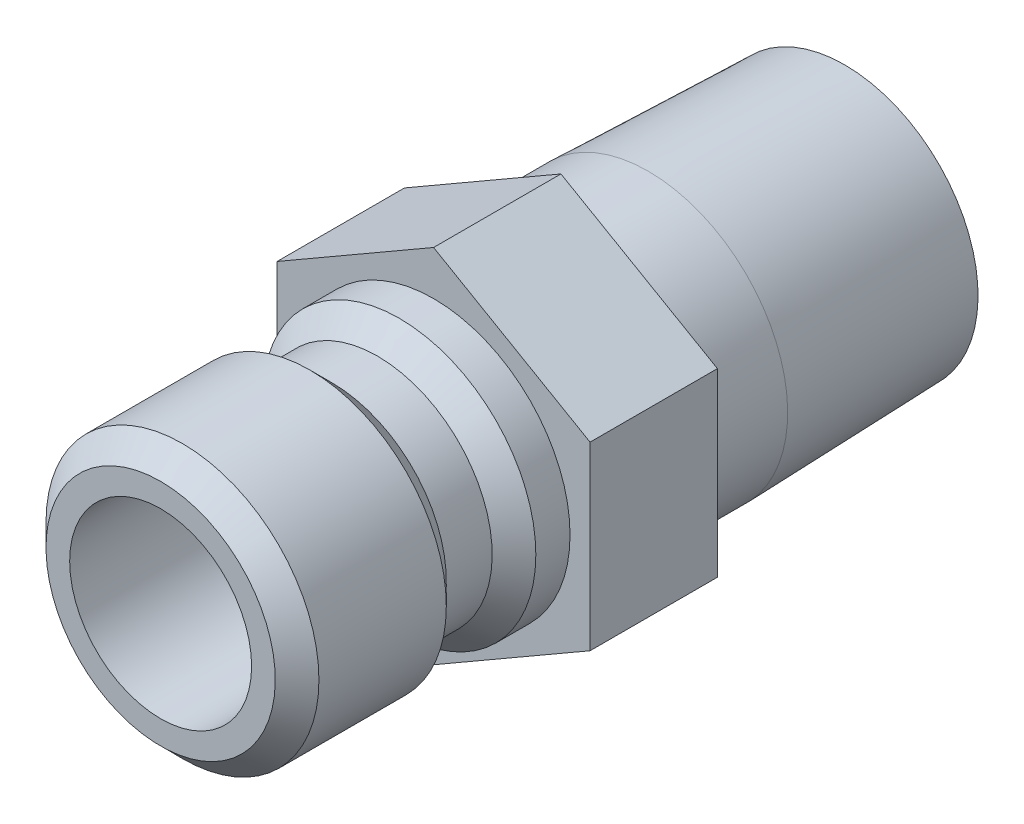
ISO-10303-21;
HEADER;
FILE_DESCRIPTION(('STEP AP214'),'2;1');
FILE_NAME('part.step','',(''),(''),'','','');
FILE_SCHEMA(('AUTOMOTIVE_DESIGN { 1 0 10303 214 1 1 1 1 }'));
ENDSEC;
DATA;
#1=APPLICATION_CONTEXT('core data for automotive mechanical design processes');
#2=APPLICATION_PROTOCOL_DEFINITION('international standard','automotive_design',2000,#1);
#3=PRODUCT_CONTEXT('',#1,'mechanical');
#4=PRODUCT('Part','Part','',(#3));
#5=PRODUCT_RELATED_PRODUCT_CATEGORY('part','',(#4));
#6=PRODUCT_DEFINITION_FORMATION('','',#4);
#7=PRODUCT_DEFINITION_CONTEXT('part definition',#1,'design');
#8=PRODUCT_DEFINITION('design','',#6,#7);
#9=PRODUCT_DEFINITION_SHAPE('','',#8);
#10=(LENGTH_UNIT() NAMED_UNIT(*) SI_UNIT(.MILLI.,.METRE.));
#11=(NAMED_UNIT(*) PLANE_ANGLE_UNIT() SI_UNIT($,.RADIAN.));
#12=(NAMED_UNIT(*) SI_UNIT($,.STERADIAN.) SOLID_ANGLE_UNIT());
#13=UNCERTAINTY_MEASURE_WITH_UNIT(LENGTH_MEASURE(1.E-05),#10,'distance_accuracy_value','');
#14=(GEOMETRIC_REPRESENTATION_CONTEXT(3) GLOBAL_UNCERTAINTY_ASSIGNED_CONTEXT((#13)) GLOBAL_UNIT_ASSIGNED_CONTEXT((#10,
#11,#12)) REPRESENTATION_CONTEXT('',''));
#15=CARTESIAN_POINT('',(0.,0.,0.));
#16=DIRECTION('',(0.,0.,1.));
#17=DIRECTION('',(1.,0.,0.));
#18=AXIS2_PLACEMENT_3D('',#15,#16,#17);
#19=CARTESIAN_POINT('',(0.,0.,0.));
#20=DIRECTION('',(0.,0.,-1.));
#21=DIRECTION('',(0.,1.,0.));
#22=AXIS2_PLACEMENT_3D('',#19,#20,#21);
#23=CYLINDRICAL_SURFACE('',#22,4.8641);
#24=CARTESIAN_POINT('',(0.,0.,-7.493));
#25=DIRECTION('',(0.,0.,-1.));
#26=DIRECTION('',(0.,1.,0.));
#27=AXIS2_PLACEMENT_3D('',#24,#25,#26);
#28=CIRCLE('',#27,4.8641);
#29=CARTESIAN_POINT('',(0.,4.8641,-7.493));
#30=VERTEX_POINT('',#29);
#31=EDGE_CURVE('E160',#30,#30,#28,.T.);
#32=ORIENTED_EDGE('',*,*,#31,.F.);
#33=EDGE_LOOP('',(#32));
#34=FACE_BOUND('',#33,.T.);
#35=CARTESIAN_POINT('',(0.,0.,-4.445));
#36=DIRECTION('',(0.,0.,1.));
#37=DIRECTION('',(1.,0.,0.));
#38=AXIS2_PLACEMENT_3D('',#35,#36,#37);
#39=CIRCLE('',#38,4.8641);
#40=CARTESIAN_POINT('',(4.8641,0.,-4.445));
#41=VERTEX_POINT('',#40);
#42=EDGE_CURVE('E41',#41,#41,#39,.F.);
#43=ORIENTED_EDGE('',*,*,#42,.T.);
#44=EDGE_LOOP('',(#43));
#45=FACE_BOUND('',#44,.T.);
#46=ADVANCED_FACE('F37',(#34,#45),#23,.T.);
#47=CARTESIAN_POINT('',(0.,0.,0.));
#48=DIRECTION('',(0.,0.,-1.));
#49=DIRECTION('',(0.,1.,0.));
#50=AXIS2_PLACEMENT_3D('',#47,#48,#49);
#51=CYLINDRICAL_SURFACE('',#50,3.175);
#52=CARTESIAN_POINT('',(0.,0.,9.525));
#53=DIRECTION('',(0.,0.,-1.));
#54=DIRECTION('',(0.,1.,0.));
#55=AXIS2_PLACEMENT_3D('',#52,#53,#54);
#56=CIRCLE('',#55,3.175);
#57=CARTESIAN_POINT('',(0.,3.175,9.525));
#58=VERTEX_POINT('',#57);
#59=EDGE_CURVE('E11',#58,#58,#56,.T.);
#60=ORIENTED_EDGE('',*,*,#59,.F.);
#61=EDGE_LOOP('',(#60));
#62=FACE_BOUND('',#61,.T.);
#63=CARTESIAN_POINT('',(0.,0.,-0.126999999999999));
#64=DIRECTION('',(0.,0.,-1.));
#65=DIRECTION('',(0.,1.,0.));
#66=AXIS2_PLACEMENT_3D('',#63,#64,#65);
#67=CIRCLE('',#66,3.175);
#68=CARTESIAN_POINT('',(0.,3.175,-0.126999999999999));
#69=VERTEX_POINT('',#68);
#70=EDGE_CURVE('E148',#69,#69,#67,.T.);
#71=ORIENTED_EDGE('',*,*,#70,.T.);
#72=EDGE_LOOP('',(#71));
#73=FACE_BOUND('',#72,.T.);
#74=ADVANCED_FACE('F39',(#62,#73),#51,.F.);
#75=CARTESIAN_POINT('',(0.,3.175,9.525));
#76=DIRECTION('',(0.,0.,1.));
#77=DIRECTION('',(0.,-1.,0.));
#78=AXIS2_PLACEMENT_3D('',#75,#76,#77);
#79=PLANE('',#78);
#80=ORIENTED_EDGE('',*,*,#59,.T.);
#81=EDGE_LOOP('',(#80));
#82=FACE_BOUND('',#81,.T.);
#83=CARTESIAN_POINT('',(0.,0.,9.525));
#84=DIRECTION('',(0.,0.,-1.));
#85=DIRECTION('',(0.,1.,0.));
#86=AXIS2_PLACEMENT_3D('',#83,#84,#85);
#87=CIRCLE('',#86,4.0005);
#88=CARTESIAN_POINT('',(0.,4.0005,9.525));
#89=VERTEX_POINT('',#88);
#90=EDGE_CURVE('E47',#89,#89,#87,.T.);
#91=ORIENTED_EDGE('',*,*,#90,.F.);
#92=EDGE_LOOP('',(#91));
#93=FACE_BOUND('',#92,.T.);
#94=ADVANCED_FACE('F187',(#82,#93),#79,.T.);
#95=CARTESIAN_POINT('',(0.,0.,8.763));
#96=DIRECTION('',(0.,0.,-1.));
#97=DIRECTION('',(0.,1.,0.));
#98=AXIS2_PLACEMENT_3D('',#95,#96,#97);
#99=CONICAL_SURFACE('',#98,4.7625,0.785398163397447);
#100=ORIENTED_EDGE('',*,*,#90,.T.);
#101=EDGE_LOOP('',(#100));
#102=FACE_BOUND('',#101,.T.);
#103=CARTESIAN_POINT('',(0.,0.,8.763));
#104=DIRECTION('',(0.,0.,-1.));
#105=DIRECTION('',(0.,1.,0.));
#106=AXIS2_PLACEMENT_3D('',#103,#104,#105);
#107=CIRCLE('',#106,4.7625);
#108=CARTESIAN_POINT('',(0.,4.7625,8.763));
#109=VERTEX_POINT('',#108);
#110=EDGE_CURVE('E178',#109,#109,#107,.T.);
#111=ORIENTED_EDGE('',*,*,#110,.F.);
#112=EDGE_LOOP('',(#111));
#113=FACE_BOUND('',#112,.T.);
#114=ADVANCED_FACE('F184',(#102,#113),#99,.T.);
#115=CARTESIAN_POINT('',(0.,0.,0.));
#116=DIRECTION('',(0.,0.,-1.));
#117=DIRECTION('',(0.,1.,0.));
#118=AXIS2_PLACEMENT_3D('',#115,#116,#117);
#119=CYLINDRICAL_SURFACE('',#118,4.7625);
#120=ORIENTED_EDGE('',*,*,#110,.T.);
#121=EDGE_LOOP('',(#120));
#122=FACE_BOUND('',#121,.T.);
#123=CARTESIAN_POINT('',(0.,0.,4.318));
#124=DIRECTION('',(0.,0.,-1.));
#125=DIRECTION('',(0.,1.,0.));
#126=AXIS2_PLACEMENT_3D('',#123,#124,#125);
#127=CIRCLE('',#126,4.7625);
#128=CARTESIAN_POINT('',(0.,4.7625,4.318));
#129=VERTEX_POINT('',#128);
#130=EDGE_CURVE('E175',#129,#129,#127,.T.);
#131=ORIENTED_EDGE('',*,*,#130,.F.);
#132=EDGE_LOOP('',(#131));
#133=FACE_BOUND('',#132,.T.);
#134=ADVANCED_FACE('F194',(#122,#133),#119,.T.);
#135=CARTESIAN_POINT('',(0.,0.,3.556));
#136=DIRECTION('',(0.,0.,1.));
#137=DIRECTION('',(0.,-1.,0.));
#138=AXIS2_PLACEMENT_3D('',#135,#136,#137);
#139=CONICAL_SURFACE('',#138,4.0005,0.785398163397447);
#140=ORIENTED_EDGE('',*,*,#130,.T.);
#141=EDGE_LOOP('',(#140));
#142=FACE_BOUND('',#141,.T.);
#143=CARTESIAN_POINT('',(0.,0.,3.556));
#144=DIRECTION('',(0.,0.,-1.));
#145=DIRECTION('',(0.,1.,0.));
#146=AXIS2_PLACEMENT_3D('',#143,#144,#145);
#147=CIRCLE('',#146,4.0005);
#148=CARTESIAN_POINT('',(0.,4.0005,3.556));
#149=VERTEX_POINT('',#148);
#150=EDGE_CURVE('E172',#149,#149,#147,.T.);
#151=ORIENTED_EDGE('',*,*,#150,.F.);
#152=EDGE_LOOP('',(#151));
#153=FACE_BOUND('',#152,.T.);
#154=ADVANCED_FACE('F223',(#142,#153),#139,.T.);
#155=CARTESIAN_POINT('',(0.,0.,0.));
#156=DIRECTION('',(0.,0.,-1.));
#157=DIRECTION('',(0.,1.,0.));
#158=AXIS2_PLACEMENT_3D('',#155,#156,#157);
#159=CYLINDRICAL_SURFACE('',#158,4.0005);
#160=ORIENTED_EDGE('',*,*,#150,.T.);
#161=EDGE_LOOP('',(#160));
#162=FACE_BOUND('',#161,.T.);
#163=CARTESIAN_POINT('',(0.,0.,1.9558));
#164=DIRECTION('',(0.,0.,-1.));
#165=DIRECTION('',(0.,1.,0.));
#166=AXIS2_PLACEMENT_3D('',#163,#164,#165);
#167=CIRCLE('',#166,4.0005);
#168=CARTESIAN_POINT('',(0.,4.0005,1.9558));
#169=VERTEX_POINT('',#168);
#170=EDGE_CURVE('E169',#169,#169,#167,.T.);
#171=ORIENTED_EDGE('',*,*,#170,.F.);
#172=EDGE_LOOP('',(#171));
#173=FACE_BOUND('',#172,.T.);
#174=ADVANCED_FACE('F219',(#162,#173),#159,.T.);
#175=CARTESIAN_POINT('',(0.,0.,1.1938));
#176=DIRECTION('',(0.,0.,-1.));
#177=DIRECTION('',(0.,1.,0.));
#178=AXIS2_PLACEMENT_3D('',#175,#176,#177);
#179=CONICAL_SURFACE('',#178,4.7625,0.785398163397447);
#180=ORIENTED_EDGE('',*,*,#170,.T.);
#181=EDGE_LOOP('',(#180));
#182=FACE_BOUND('',#181,.T.);
#183=CARTESIAN_POINT('',(0.,0.,1.1938));
#184=DIRECTION('',(0.,0.,-1.));
#185=DIRECTION('',(0.,1.,0.));
#186=AXIS2_PLACEMENT_3D('',#183,#184,#185);
#187=CIRCLE('',#186,4.7625);
#188=CARTESIAN_POINT('',(0.,4.7625,1.1938));
#189=VERTEX_POINT('',#188);
#190=EDGE_CURVE('E166',#189,#189,#187,.T.);
#191=ORIENTED_EDGE('',*,*,#190,.F.);
#192=EDGE_LOOP('',(#191));
#193=FACE_BOUND('',#192,.T.);
#194=ADVANCED_FACE('F215',(#182,#193),#179,.T.);
#195=CARTESIAN_POINT('',(0.,0.,0.));
#196=DIRECTION('',(0.,0.,-1.));
#197=DIRECTION('',(0.,1.,0.));
#198=AXIS2_PLACEMENT_3D('',#195,#196,#197);
#199=CYLINDRICAL_SURFACE('',#198,4.7625);
#200=ORIENTED_EDGE('',*,*,#190,.T.);
#201=EDGE_LOOP('',(#200));
#202=FACE_BOUND('',#201,.T.);
#203=CARTESIAN_POINT('',(0.,0.,0.));
#204=DIRECTION('',(0.,0.,-1.));
#205=DIRECTION('',(0.,1.,0.));
#206=AXIS2_PLACEMENT_3D('',#203,#204,#205);
#207=CIRCLE('',#206,4.7625);
#208=CARTESIAN_POINT('',(0.,4.7625,0.));
#209=VERTEX_POINT('',#208);
#210=EDGE_CURVE('E163',#209,#209,#207,.T.);
#211=ORIENTED_EDGE('',*,*,#210,.F.);
#212=EDGE_LOOP('',(#211));
#213=FACE_BOUND('',#212,.T.);
#214=ADVANCED_FACE('F211',(#202,#213),#199,.T.);
#215=CARTESIAN_POINT('',(0.,4.7625,0.));
#216=DIRECTION('',(0.,0.,1.));
#217=DIRECTION('',(0.,-1.,0.));
#218=AXIS2_PLACEMENT_3D('',#215,#216,#217);
#219=PLANE('',#218);
#220=ORIENTED_EDGE('',*,*,#210,.T.);
#221=EDGE_LOOP('',(#220));
#222=FACE_BOUND('',#221,.T.);
#223=DIRECTION('',(-0.866025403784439,-0.5,0.));
#224=VECTOR('',#223,1.);
#225=CARTESIAN_POINT('',(0.,6.30581964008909,0.));
#226=LINE('',#225,#224);
#227=CARTESIAN_POINT('',(0.,6.30581964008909,0.));
#228=VERTEX_POINT('',#227);
#229=CARTESIAN_POINT('',(-5.461,3.15290982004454,0.));
#230=VERTEX_POINT('',#229);
#231=EDGE_CURVE('E126',#228,#230,#226,.T.);
#232=ORIENTED_EDGE('',*,*,#231,.T.);
#233=DIRECTION('',(0.,-1.,0.));
#234=VECTOR('',#233,1.);
#235=CARTESIAN_POINT('',(-5.461,3.15290982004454,0.));
#236=LINE('',#235,#234);
#237=CARTESIAN_POINT('',(-5.461,-3.15290982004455,0.));
#238=VERTEX_POINT('',#237);
#239=EDGE_CURVE('E129',#230,#238,#236,.T.);
#240=ORIENTED_EDGE('',*,*,#239,.T.);
#241=DIRECTION('',(0.866025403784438,-0.5,0.));
#242=VECTOR('',#241,1.);
#243=CARTESIAN_POINT('',(-5.461,-3.15290982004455,0.));
#244=LINE('',#243,#242);
#245=CARTESIAN_POINT('',(0.,-6.30581964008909,0.));
#246=VERTEX_POINT('',#245);
#247=EDGE_CURVE('E132',#238,#246,#244,.T.);
#248=ORIENTED_EDGE('',*,*,#247,.T.);
#249=DIRECTION('',(0.866025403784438,0.5,0.));
#250=VECTOR('',#249,1.);
#251=CARTESIAN_POINT('',(0.,-6.30581964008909,0.));
#252=LINE('',#251,#250);
#253=CARTESIAN_POINT('',(5.461,-3.15290982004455,0.));
#254=VERTEX_POINT('',#253);
#255=EDGE_CURVE('E135',#246,#254,#252,.T.);
#256=ORIENTED_EDGE('',*,*,#255,.T.);
#257=DIRECTION('',(0.,1.,0.));
#258=VECTOR('',#257,1.);
#259=CARTESIAN_POINT('',(5.461,-3.15290982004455,0.));
#260=LINE('',#259,#258);
#261=CARTESIAN_POINT('',(5.461,3.15290982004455,0.));
#262=VERTEX_POINT('',#261);
#263=EDGE_CURVE('E103',#254,#262,#260,.T.);
#264=ORIENTED_EDGE('',*,*,#263,.T.);
#265=DIRECTION('',(-0.866025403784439,0.5,0.));
#266=VECTOR('',#265,1.);
#267=CARTESIAN_POINT('',(5.461,3.15290982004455,0.));
#268=LINE('',#267,#266);
#269=EDGE_CURVE('E138',#262,#228,#268,.T.);
#270=ORIENTED_EDGE('',*,*,#269,.T.);
#271=EDGE_LOOP('',(#232,#240,#248,#256,#264,#270));
#272=FACE_BOUND('',#271,.T.);
#273=ADVANCED_FACE('F208',(#222,#272),#219,.T.);
#274=CARTESIAN_POINT('',(0.,0.,-14.351));
#275=DIRECTION('',(0.,0.,1.));
#276=DIRECTION('',(0.,-1.,0.));
#277=AXIS2_PLACEMENT_3D('',#274,#275,#276);
#278=CONICAL_SURFACE('',#277,4.6497887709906,0.0312396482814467);
#279=ORIENTED_EDGE('',*,*,#31,.T.);
#280=EDGE_LOOP('',(#279));
#281=FACE_BOUND('',#280,.T.);
#282=CARTESIAN_POINT('',(0.,0.,-14.351));
#283=DIRECTION('',(0.,0.,-1.));
#284=DIRECTION('',(0.,1.,0.));
#285=AXIS2_PLACEMENT_3D('',#282,#283,#284);
#286=CIRCLE('',#285,4.6497887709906);
#287=CARTESIAN_POINT('',(0.,4.6497887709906,-14.351));
#288=VERTEX_POINT('',#287);
#289=EDGE_CURVE('E157',#288,#288,#286,.T.);
#290=ORIENTED_EDGE('',*,*,#289,.F.);
#291=EDGE_LOOP('',(#290));
#292=FACE_BOUND('',#291,.T.);
#293=ADVANCED_FACE('F206',(#281,#292),#278,.T.);
#294=CARTESIAN_POINT('',(0.,4.6497887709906,-14.351));
#295=DIRECTION('',(0.,0.,-1.));
#296=DIRECTION('',(0.,1.,0.));
#297=AXIS2_PLACEMENT_3D('',#294,#295,#296);
#298=PLANE('',#297);
#299=ORIENTED_EDGE('',*,*,#289,.T.);
#300=EDGE_LOOP('',(#299));
#301=FACE_BOUND('',#300,.T.);
#302=CARTESIAN_POINT('',(0.,0.,-14.351));
#303=DIRECTION('',(0.,0.,-1.));
#304=DIRECTION('',(0.,1.,0.));
#305=AXIS2_PLACEMENT_3D('',#302,#303,#304);
#306=CIRCLE('',#305,2.9464);
#307=CARTESIAN_POINT('',(0.,2.9464,-14.351));
#308=VERTEX_POINT('',#307);
#309=EDGE_CURVE('E154',#308,#308,#306,.T.);
#310=ORIENTED_EDGE('',*,*,#309,.F.);
#311=EDGE_LOOP('',(#310));
#312=FACE_BOUND('',#311,.T.);
#313=ADVANCED_FACE('F272',(#301,#312),#298,.T.);
#314=CARTESIAN_POINT('',(0.,0.,0.));
#315=DIRECTION('',(0.,0.,-1.));
#316=DIRECTION('',(0.,1.,0.));
#317=AXIS2_PLACEMENT_3D('',#314,#315,#316);
#318=CYLINDRICAL_SURFACE('',#317,2.9464);
#319=ORIENTED_EDGE('',*,*,#309,.T.);
#320=EDGE_LOOP('',(#319));
#321=FACE_BOUND('',#320,.T.);
#322=CARTESIAN_POINT('',(0.,0.,-0.126999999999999));
#323=DIRECTION('',(0.,0.,-1.));
#324=DIRECTION('',(0.,1.,0.));
#325=AXIS2_PLACEMENT_3D('',#322,#323,#324);
#326=CIRCLE('',#325,2.9464);
#327=CARTESIAN_POINT('',(0.,2.9464,-0.126999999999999));
#328=VERTEX_POINT('',#327);
#329=EDGE_CURVE('E151',#328,#328,#326,.T.);
#330=ORIENTED_EDGE('',*,*,#329,.F.);
#331=EDGE_LOOP('',(#330));
#332=FACE_BOUND('',#331,.T.);
#333=ADVANCED_FACE('F269',(#321,#332),#318,.F.);
#334=CARTESIAN_POINT('',(0.,3.175,-0.126999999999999));
#335=DIRECTION('',(0.,0.,1.));
#336=DIRECTION('',(0.,-1.,0.));
#337=AXIS2_PLACEMENT_3D('',#334,#335,#336);
#338=PLANE('',#337);
#339=ORIENTED_EDGE('',*,*,#329,.T.);
#340=EDGE_LOOP('',(#339));
#341=FACE_BOUND('',#340,.T.);
#342=ORIENTED_EDGE('',*,*,#70,.F.);
#343=EDGE_LOOP('',(#342));
#344=FACE_BOUND('',#343,.T.);
#345=ADVANCED_FACE('F257',(#341,#344),#338,.T.);
#346=CARTESIAN_POINT('',(0.,6.30581964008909,-4.445));
#347=DIRECTION('',(-0.5,0.866025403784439,0.));
#348=DIRECTION('',(-0.866025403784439,-0.5,0.));
#349=AXIS2_PLACEMENT_3D('',#346,#347,#348);
#350=PLANE('',#349);
#351=ORIENTED_EDGE('',*,*,#231,.F.);
#352=DIRECTION('',(0.,0.,1.));
#353=VECTOR('',#352,1.);
#354=CARTESIAN_POINT('',(0.,6.30581964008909,-4.445));
#355=LINE('',#354,#353);
#356=CARTESIAN_POINT('',(0.,6.30581964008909,-4.445));
#357=VERTEX_POINT('',#356);
#358=EDGE_CURVE('E55',#357,#228,#355,.T.);
#359=ORIENTED_EDGE('',*,*,#358,.F.);
#360=DIRECTION('',(-0.866025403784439,-0.5,0.));
#361=VECTOR('',#360,1.);
#362=CARTESIAN_POINT('',(0.,6.30581964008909,-4.445));
#363=LINE('',#362,#361);
#364=CARTESIAN_POINT('',(-5.461,3.15290982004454,-4.445));
#365=VERTEX_POINT('',#364);
#366=EDGE_CURVE('E141',#357,#365,#363,.T.);
#367=ORIENTED_EDGE('',*,*,#366,.T.);
#368=DIRECTION('',(0.,0.,1.));
#369=VECTOR('',#368,1.);
#370=CARTESIAN_POINT('',(-5.461,3.15290982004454,-4.445));
#371=LINE('',#370,#369);
#372=EDGE_CURVE('E90',#365,#230,#371,.T.);
#373=ORIENTED_EDGE('',*,*,#372,.T.);
#374=EDGE_LOOP('',(#351,#359,#367,#373));
#375=FACE_BOUND('',#374,.T.);
#376=ADVANCED_FACE('F244',(#375),#350,.T.);
#377=CARTESIAN_POINT('',(5.461,3.15290982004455,-4.445));
#378=DIRECTION('',(0.5,0.866025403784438,0.));
#379=DIRECTION('',(-0.866025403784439,0.5,0.));
#380=AXIS2_PLACEMENT_3D('',#377,#378,#379);
#381=PLANE('',#380);
#382=ORIENTED_EDGE('',*,*,#269,.F.);
#383=DIRECTION('',(0.,0.,1.));
#384=VECTOR('',#383,1.);
#385=CARTESIAN_POINT('',(5.461,3.15290982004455,-4.445));
#386=LINE('',#385,#384);
#387=CARTESIAN_POINT('',(5.461,3.15290982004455,-4.445));
#388=VERTEX_POINT('',#387);
#389=EDGE_CURVE('E78',#388,#262,#386,.T.);
#390=ORIENTED_EDGE('',*,*,#389,.F.);
#391=DIRECTION('',(-0.866025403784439,0.5,0.));
#392=VECTOR('',#391,1.);
#393=CARTESIAN_POINT('',(5.461,3.15290982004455,-4.445));
#394=LINE('',#393,#392);
#395=EDGE_CURVE('E116',#388,#357,#394,.T.);
#396=ORIENTED_EDGE('',*,*,#395,.T.);
#397=ORIENTED_EDGE('',*,*,#358,.T.);
#398=EDGE_LOOP('',(#382,#390,#396,#397));
#399=FACE_BOUND('',#398,.T.);
#400=ADVANCED_FACE('F249',(#399),#381,.T.);
#401=CARTESIAN_POINT('',(5.461,-3.15290982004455,-4.445));
#402=DIRECTION('',(1.,0.,0.));
#403=DIRECTION('',(0.,0.,-1.));
#404=AXIS2_PLACEMENT_3D('',#401,#402,#403);
#405=PLANE('',#404);
#406=ORIENTED_EDGE('',*,*,#263,.F.);
#407=DIRECTION('',(0.,0.,1.));
#408=VECTOR('',#407,1.);
#409=CARTESIAN_POINT('',(5.461,-3.15290982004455,-4.445));
#410=LINE('',#409,#408);
#411=CARTESIAN_POINT('',(5.461,-3.15290982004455,-4.445));
#412=VERTEX_POINT('',#411);
#413=EDGE_CURVE('E98',#412,#254,#410,.T.);
#414=ORIENTED_EDGE('',*,*,#413,.F.);
#415=DIRECTION('',(0.,1.,0.));
#416=VECTOR('',#415,1.);
#417=CARTESIAN_POINT('',(5.461,-3.15290982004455,-4.445));
#418=LINE('',#417,#416);
#419=EDGE_CURVE('E101',#412,#388,#418,.T.);
#420=ORIENTED_EDGE('',*,*,#419,.T.);
#421=ORIENTED_EDGE('',*,*,#389,.T.);
#422=EDGE_LOOP('',(#406,#414,#420,#421));
#423=FACE_BOUND('',#422,.T.);
#424=ADVANCED_FACE('F100',(#423),#405,.T.);
#425=CARTESIAN_POINT('',(0.,-6.30581964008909,-4.445));
#426=DIRECTION('',(0.5,-0.866025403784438,0.));
#427=DIRECTION('',(0.866025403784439,0.5,0.));
#428=AXIS2_PLACEMENT_3D('',#425,#426,#427);
#429=PLANE('',#428);
#430=ORIENTED_EDGE('',*,*,#255,.F.);
#431=DIRECTION('',(0.,0.,1.));
#432=VECTOR('',#431,1.);
#433=CARTESIAN_POINT('',(0.,-6.30581964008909,-4.445));
#434=LINE('',#433,#432);
#435=CARTESIAN_POINT('',(0.,-6.30581964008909,-4.445));
#436=VERTEX_POINT('',#435);
#437=EDGE_CURVE('E108',#436,#246,#434,.T.);
#438=ORIENTED_EDGE('',*,*,#437,.F.);
#439=DIRECTION('',(0.866025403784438,0.5,0.));
#440=VECTOR('',#439,1.);
#441=CARTESIAN_POINT('',(0.,-6.30581964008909,-4.445));
#442=LINE('',#441,#440);
#443=EDGE_CURVE('E114',#436,#412,#442,.T.);
#444=ORIENTED_EDGE('',*,*,#443,.T.);
#445=ORIENTED_EDGE('',*,*,#413,.T.);
#446=EDGE_LOOP('',(#430,#438,#444,#445));
#447=FACE_BOUND('',#446,.T.);
#448=ADVANCED_FACE('F118',(#447),#429,.T.);
#449=CARTESIAN_POINT('',(-5.461,-3.15290982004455,-4.445));
#450=DIRECTION('',(-0.5,-0.866025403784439,0.));
#451=DIRECTION('',(0.866025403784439,-0.5,0.));
#452=AXIS2_PLACEMENT_3D('',#449,#450,#451);
#453=PLANE('',#452);
#454=ORIENTED_EDGE('',*,*,#247,.F.);
#455=DIRECTION('',(0.,0.,1.));
#456=VECTOR('',#455,1.);
#457=CARTESIAN_POINT('',(-5.461,-3.15290982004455,-4.445));
#458=LINE('',#457,#456);
#459=CARTESIAN_POINT('',(-5.461,-3.15290982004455,-4.445));
#460=VERTEX_POINT('',#459);
#461=EDGE_CURVE('E145',#460,#238,#458,.T.);
#462=ORIENTED_EDGE('',*,*,#461,.F.);
#463=DIRECTION('',(0.866025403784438,-0.5,0.));
#464=VECTOR('',#463,1.);
#465=CARTESIAN_POINT('',(-5.461,-3.15290982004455,-4.445));
#466=LINE('',#465,#464);
#467=EDGE_CURVE('E119',#460,#436,#466,.T.);
#468=ORIENTED_EDGE('',*,*,#467,.T.);
#469=ORIENTED_EDGE('',*,*,#437,.T.);
#470=EDGE_LOOP('',(#454,#462,#468,#469));
#471=FACE_BOUND('',#470,.T.);
#472=ADVANCED_FACE('F248',(#471),#453,.T.);
#473=CARTESIAN_POINT('',(-5.461,3.15290982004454,-4.445));
#474=DIRECTION('',(-1.,0.,0.));
#475=DIRECTION('',(0.,0.,1.));
#476=AXIS2_PLACEMENT_3D('',#473,#474,#475);
#477=PLANE('',#476);
#478=ORIENTED_EDGE('',*,*,#239,.F.);
#479=ORIENTED_EDGE('',*,*,#372,.F.);
#480=DIRECTION('',(0.,-1.,0.));
#481=VECTOR('',#480,1.);
#482=CARTESIAN_POINT('',(-5.461,3.15290982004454,-4.445));
#483=LINE('',#482,#481);
#484=EDGE_CURVE('E121',#365,#460,#483,.T.);
#485=ORIENTED_EDGE('',*,*,#484,.T.);
#486=ORIENTED_EDGE('',*,*,#461,.T.);
#487=EDGE_LOOP('',(#478,#479,#485,#486));
#488=FACE_BOUND('',#487,.T.);
#489=ADVANCED_FACE('F245',(#488),#477,.T.);
#490=CARTESIAN_POINT('',(-5.461,3.15290982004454,-4.445));
#491=DIRECTION('',(0.,0.,1.));
#492=DIRECTION('',(1.,0.,0.));
#493=AXIS2_PLACEMENT_3D('',#490,#491,#492);
#494=PLANE('',#493);
#495=ORIENTED_EDGE('',*,*,#42,.F.);
#496=EDGE_LOOP('',(#495));
#497=FACE_BOUND('',#496,.T.);
#498=ORIENTED_EDGE('',*,*,#366,.F.);
#499=ORIENTED_EDGE('',*,*,#395,.F.);
#500=ORIENTED_EDGE('',*,*,#419,.F.);
#501=ORIENTED_EDGE('',*,*,#443,.F.);
#502=ORIENTED_EDGE('',*,*,#467,.F.);
#503=ORIENTED_EDGE('',*,*,#484,.F.);
#504=EDGE_LOOP('',(#498,#499,#500,#501,#502,#503));
#505=FACE_BOUND('',#504,.T.);
#506=ADVANCED_FACE('F112',(#497,#505),#494,.F.);
#507=CLOSED_SHELL('',(#46,#74,#94,#114,#134,#154,#174,#194,#214,#273,#293,#313,#333,#345,#376,
#400,#424,#448,#472,#489,#506));
#508=MANIFOLD_SOLID_BREP('B2',#507);
#509=ADVANCED_BREP_SHAPE_REPRESENTATION('',(#18,#508),#14);
#510=SHAPE_DEFINITION_REPRESENTATION(#9,#509);
ENDSEC;
END-ISO-10303-21;
